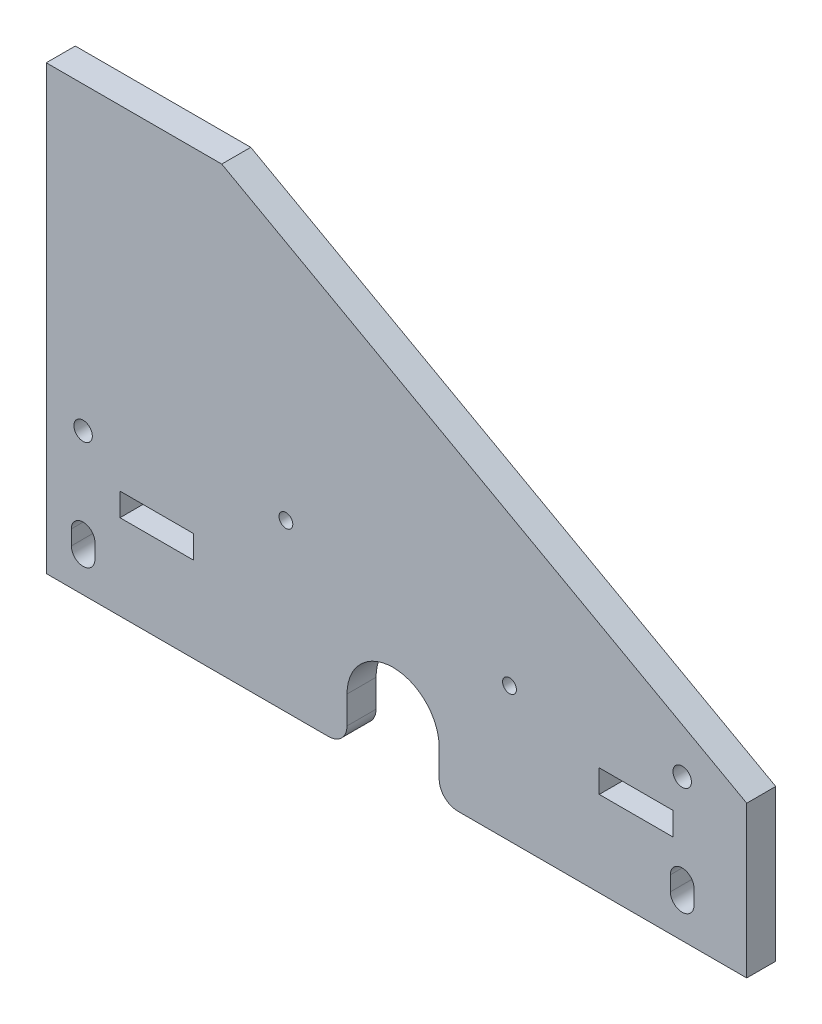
from build123d import *

# Parameters (mm, degrees)
SKETCH1_R           = 3.175
SKETCH1_R_2         = 2.38125
SKETCH1_W           = 25.4
SKETCH1_H           = 7.9375
BOSS_EXTRUDE1_DEPTH = 10


with BuildPart() as part:
    # Sketch1 → Boss-Extrude1 (new body)
    with BuildSketch(Plane.XY.offset(10)):
        with BuildLine():
            Line((-60.669492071, -24.581916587), (38.921367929, -24.581916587))
            Line((38.921367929, -24.581916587), (38.921367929, 27.572400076))
            Line((38.921367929, 27.572400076), (-141.926632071, 127.818083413))
            Line((-141.926632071, 127.818083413), (-202.378632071, 127.818083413))
            Line((-202.378632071, 127.818083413), (-202.378632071, -24.581916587))
            Line((-202.378632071, -24.581916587), (-105.119492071, -24.581916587))
            ThreePointArc((-105.119492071, -24.581916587), (-100.62936401, -22.722044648), (-98.769492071, -18.231916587))
            Line((-98.769492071, -18.231916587), (-98.769492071, -8.706916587))
            ThreePointArc((-98.769492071, -8.706916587), (-82.894492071, 7.168083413), (-67.019492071, -8.706916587))
            Line((-67.019492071, -8.706916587), (-67.019492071, -18.231916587))
            ThreePointArc((-67.019492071, -18.231916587), (-65.159620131, -22.722044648), (-60.669492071, -24.581916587))
        make_face()
        with Locations(Location((16.696367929, 24.358803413, 0), (0, 0, 180))):
            Circle(SKETCH1_R, mode=Mode.SUBTRACT)
        with Locations(Location((-42.792972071, 21.773083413, 0), (0, 0, 180))):
            Circle(SKETCH1_R_2, mode=Mode.SUBTRACT)
        with Locations(Location((-119.828632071, 32.568083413, 0), (0, 0, 180))):
            Circle(SKETCH1_R_2, mode=Mode.SUBTRACT)
        with Locations(Location((-189.678632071, 24.358803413, 0), (0, 0, 180))):
            Circle(SKETCH1_R, mode=Mode.SUBTRACT)
        with BuildLine():
            Line((12.632367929, -12.008916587), (12.632367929, -6.928916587))
            ThreePointArc((12.632367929, -6.928916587), (16.696367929, -2.864916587), (20.760367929, -6.928916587))
            Line((20.760367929, -6.928916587), (20.760367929, -12.008916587))
            ThreePointArc((20.760367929, -12.008916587), (16.696367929, -16.072916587), (12.632367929, -12.008916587))
        make_face(mode=Mode.SUBTRACT)
        with Locations((0.821367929, 8.756853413)):
            Rectangle(SKETCH1_W, SKETCH1_H, mode=Mode.SUBTRACT)
        with BuildLine():
            Line((-193.742632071, -12.008916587), (-193.742632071, -6.928916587))
            ThreePointArc((-193.742632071, -6.928916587), (-189.678632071, -2.864916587), (-185.614632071, -6.928916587))
            Line((-185.614632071, -6.928916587), (-185.614632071, -12.008916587))
            ThreePointArc((-185.614632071, -12.008916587), (-189.678632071, -16.072916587), (-193.742632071, -12.008916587))
        make_face(mode=Mode.SUBTRACT)
        with Locations((-164.278632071, 8.756853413)):
            Rectangle(SKETCH1_W, SKETCH1_H, mode=Mode.SUBTRACT)
    extrude(amount=-BOSS_EXTRUDE1_DEPTH)


solid = part.part
